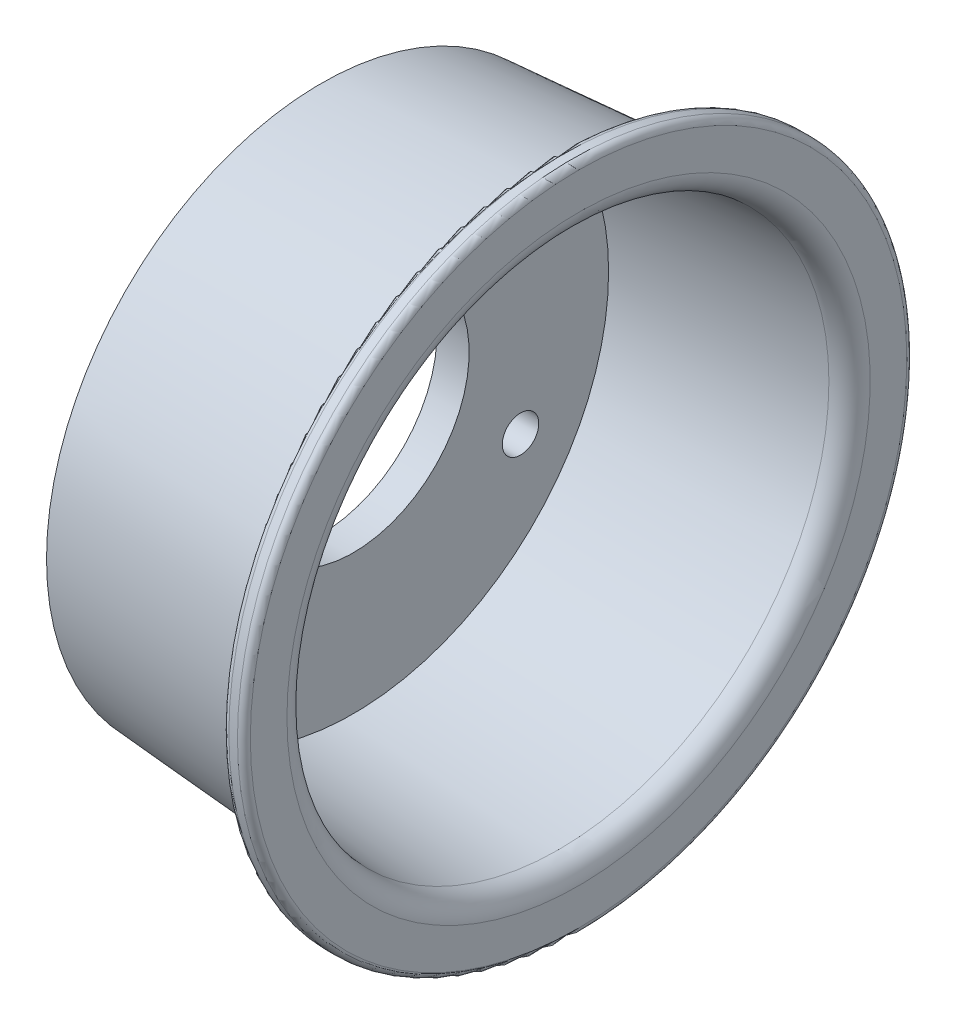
from build123d import *

# Parameters (mm, degrees)
ESQUISSE2_R                  = 27
ENL_V_MAT_EXTRU_1_DEPTH      = 210.544744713
ESQUISSE3_R                  = 4.25
ENL_V_MAT_EXTRU_2_DEPTH      = 210.544744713
R_P_TITION_CIRCULAIRE1_COUNT = 3


with BuildPart() as part:
    # Esquisse1 → Base-R_volution (revolve)
    with BuildSketch(Plane.XY, mode=Mode.PRIVATE) as base_r_volution_sk:
        with BuildLine():
            Line((-25, -107), (-25, -43))
            Line((-25, -43), (30, -39))
            Line((30, -39), (30, -30.5))
            ThreePointArc((30, -30.5), (30.439339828, -29.439339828), (31.5, -29))
            Line((31.5, -29), (33.5, -29))
            ThreePointArc((33.5, -29), (34.560660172, -29.439339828), (35, -30.5))
            Line((35, -30.5), (35, -39))
            Line((35, -39), (35, -39.032248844))
            ThreePointArc((35, -39.032248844), (33.66151556, -42.43714294), (30.362678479, -44.019077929))
            Line((30.362678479, -44.019077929), (-17.5, -47.5))
            Line((-17.5, -47.5), (-17.5, -107))
            Line((-17.5, -107), (-25, -107))
        make_face()
    revolve(base_r_volution_sk.sketch.rotate(Axis((-17.5, -107, 0), (1, 0, 0)), 90), axis=Axis((-17.5, -107, 0), (1, 0, 0)))

    # Esquisse2 → Enl_v. mat.-Extru.1 (cut, through all)
    with BuildSketch(Plane.ZY.offset(25)):
        with Locations((0, -107)):
            Circle(ESQUISSE2_R)
    extrude(amount=-ENL_V_MAT_EXTRU_1_DEPTH, mode=Mode.SUBTRACT)

    # Esquisse3 → Enl_v. mat.-Extru.2 (cut, through all)
    with BuildSketch(Plane.ZY.offset(25)):
        with Locations((-38.97114317, -129.5)):
            Circle(ESQUISSE3_R)
    enl_v_mat_extru_2 = extrude(amount=-ENL_V_MAT_EXTRU_2_DEPTH, mode=Mode.SUBTRACT)

    # R_p_tition circulaire1: Enl_v. mat.-Extru.2 ×3 about axis
    r_p_tition_circulaire1_axis = Axis((0, -107, 0), (1, 0, 0))
    for i in range(1, R_P_TITION_CIRCULAIRE1_COUNT):
        add(enl_v_mat_extru_2.rotate(r_p_tition_circulaire1_axis, i * 360 / R_P_TITION_CIRCULAIRE1_COUNT), mode=Mode.SUBTRACT)


solid = part.part
